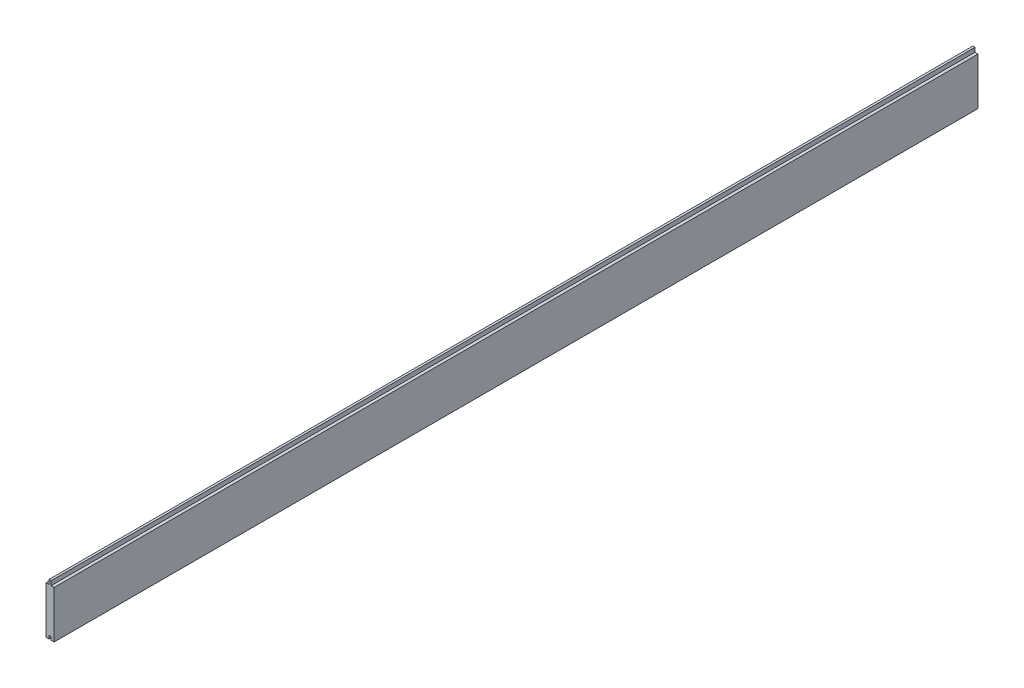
ISO-10303-21;
HEADER;
FILE_DESCRIPTION(('STEP AP214'),'2;1');
FILE_NAME('part.step','',(''),(''),'','','');
FILE_SCHEMA(('AUTOMOTIVE_DESIGN { 1 0 10303 214 1 1 1 1 }'));
ENDSEC;
DATA;
#1=APPLICATION_CONTEXT('core data for automotive mechanical design processes');
#2=APPLICATION_PROTOCOL_DEFINITION('international standard','automotive_design',2000,#1);
#3=PRODUCT_CONTEXT('',#1,'mechanical');
#4=PRODUCT('Part','Part','',(#3));
#5=PRODUCT_RELATED_PRODUCT_CATEGORY('part','',(#4));
#6=PRODUCT_DEFINITION_FORMATION('','',#4);
#7=PRODUCT_DEFINITION_CONTEXT('part definition',#1,'design');
#8=PRODUCT_DEFINITION('design','',#6,#7);
#9=PRODUCT_DEFINITION_SHAPE('','',#8);
#10=(LENGTH_UNIT() NAMED_UNIT(*) SI_UNIT(.MILLI.,.METRE.));
#11=(NAMED_UNIT(*) PLANE_ANGLE_UNIT() SI_UNIT($,.RADIAN.));
#12=(NAMED_UNIT(*) SI_UNIT($,.STERADIAN.) SOLID_ANGLE_UNIT());
#13=UNCERTAINTY_MEASURE_WITH_UNIT(LENGTH_MEASURE(1.E-05),#10,'distance_accuracy_value','');
#14=(GEOMETRIC_REPRESENTATION_CONTEXT(3) GLOBAL_UNCERTAINTY_ASSIGNED_CONTEXT((#13)) GLOBAL_UNIT_ASSIGNED_CONTEXT((#10,
#11,#12)) REPRESENTATION_CONTEXT('',''));
#15=CARTESIAN_POINT('',(0.,0.,0.));
#16=DIRECTION('',(0.,0.,1.));
#17=DIRECTION('',(1.,0.,0.));
#18=AXIS2_PLACEMENT_3D('',#15,#16,#17);
#19=CARTESIAN_POINT('',(0.,43.5,1700.));
#20=DIRECTION('',(0.,1.,0.));
#21=DIRECTION('',(0.,0.,1.));
#22=AXIS2_PLACEMENT_3D('',#19,#20,#21);
#23=PLANE('',#22);
#24=DIRECTION('',(1.,0.,0.));
#25=VECTOR('',#24,1.);
#26=CARTESIAN_POINT('',(0.,43.5,0.));
#27=LINE('',#26,#25);
#28=CARTESIAN_POINT('',(2.,43.5,0.));
#29=VERTEX_POINT('',#28);
#30=CARTESIAN_POINT('',(7.5,43.5,0.));
#31=VERTEX_POINT('',#30);
#32=EDGE_CURVE('E208',#29,#31,#27,.T.);
#33=ORIENTED_EDGE('',*,*,#32,.F.);
#34=DIRECTION('',(0.,0.,-1.));
#35=VECTOR('',#34,1.);
#36=CARTESIAN_POINT('',(2.,43.5,1700.));
#37=LINE('',#36,#35);
#38=CARTESIAN_POINT('',(2.,43.5,1700.));
#39=VERTEX_POINT('',#38);
#40=EDGE_CURVE('E11',#39,#29,#37,.T.);
#41=ORIENTED_EDGE('',*,*,#40,.F.);
#42=DIRECTION('',(1.,0.,0.));
#43=VECTOR('',#42,1.);
#44=CARTESIAN_POINT('',(0.,43.5,1700.));
#45=LINE('',#44,#43);
#46=CARTESIAN_POINT('',(7.5,43.5,1700.));
#47=VERTEX_POINT('',#46);
#48=EDGE_CURVE('E164',#39,#47,#45,.T.);
#49=ORIENTED_EDGE('',*,*,#48,.T.);
#50=DIRECTION('',(0.,0.,-1.));
#51=VECTOR('',#50,1.);
#52=CARTESIAN_POINT('',(7.5,43.5,1700.));
#53=LINE('',#52,#51);
#54=EDGE_CURVE('E49',#47,#31,#53,.T.);
#55=ORIENTED_EDGE('',*,*,#54,.T.);
#56=EDGE_LOOP('',(#33,#41,#49,#55));
#57=FACE_BOUND('',#56,.T.);
#58=ADVANCED_FACE('F32',(#57),#23,.T.);
#59=CARTESIAN_POINT('',(2.00000000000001,0.,1700.));
#60=DIRECTION('',(1.,0.,0.));
#61=DIRECTION('',(0.,1.,0.));
#62=AXIS2_PLACEMENT_3D('',#59,#60,#61);
#63=PLANE('',#62);
#64=DIRECTION('',(0.,-1.,0.));
#65=VECTOR('',#64,1.);
#66=CARTESIAN_POINT('',(2.00000000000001,0.,0.));
#67=LINE('',#66,#65);
#68=CARTESIAN_POINT('',(2.,51.5,0.));
#69=VERTEX_POINT('',#68);
#70=EDGE_CURVE('E207',#69,#29,#67,.T.);
#71=ORIENTED_EDGE('',*,*,#70,.F.);
#72=DIRECTION('',(0.,0.,-1.));
#73=VECTOR('',#72,1.);
#74=CARTESIAN_POINT('',(2.,51.5,1700.));
#75=LINE('',#74,#73);
#76=CARTESIAN_POINT('',(2.,51.5,1700.));
#77=VERTEX_POINT('',#76);
#78=EDGE_CURVE('E41',#77,#69,#75,.T.);
#79=ORIENTED_EDGE('',*,*,#78,.F.);
#80=DIRECTION('',(0.,-1.,0.));
#81=VECTOR('',#80,1.);
#82=CARTESIAN_POINT('',(2.00000000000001,0.,1700.));
#83=LINE('',#82,#81);
#84=EDGE_CURVE('E170',#77,#39,#83,.T.);
#85=ORIENTED_EDGE('',*,*,#84,.T.);
#86=ORIENTED_EDGE('',*,*,#40,.T.);
#87=EDGE_LOOP('',(#71,#79,#85,#86));
#88=FACE_BOUND('',#87,.T.);
#89=ADVANCED_FACE('F34',(#88),#63,.T.);
#90=CARTESIAN_POINT('',(0.,51.5,1700.));
#91=DIRECTION('',(0.,1.,0.));
#92=DIRECTION('',(0.,0.,1.));
#93=AXIS2_PLACEMENT_3D('',#90,#91,#92);
#94=PLANE('',#93);
#95=DIRECTION('',(1.,0.,0.));
#96=VECTOR('',#95,1.);
#97=CARTESIAN_POINT('',(0.,51.5,0.));
#98=LINE('',#97,#96);
#99=CARTESIAN_POINT('',(-2.,51.5,0.));
#100=VERTEX_POINT('',#99);
#101=EDGE_CURVE('E202',#100,#69,#98,.T.);
#102=ORIENTED_EDGE('',*,*,#101,.F.);
#103=DIRECTION('',(0.,0.,-1.));
#104=VECTOR('',#103,1.);
#105=CARTESIAN_POINT('',(-2.,51.5,1700.));
#106=LINE('',#105,#104);
#107=CARTESIAN_POINT('',(-2.,51.5,1700.));
#108=VERTEX_POINT('',#107);
#109=EDGE_CURVE('E196',#108,#100,#106,.T.);
#110=ORIENTED_EDGE('',*,*,#109,.F.);
#111=DIRECTION('',(1.,0.,0.));
#112=VECTOR('',#111,1.);
#113=CARTESIAN_POINT('',(0.,51.5,1700.));
#114=LINE('',#113,#112);
#115=EDGE_CURVE('E167',#108,#77,#114,.T.);
#116=ORIENTED_EDGE('',*,*,#115,.T.);
#117=ORIENTED_EDGE('',*,*,#78,.T.);
#118=EDGE_LOOP('',(#102,#110,#116,#117));
#119=FACE_BOUND('',#118,.T.);
#120=ADVANCED_FACE('F200',(#119),#94,.T.);
#121=CARTESIAN_POINT('',(-1.99999999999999,0.,1700.));
#122=DIRECTION('',(1.,0.,0.));
#123=DIRECTION('',(0.,1.,0.));
#124=AXIS2_PLACEMENT_3D('',#121,#122,#123);
#125=PLANE('',#124);
#126=DIRECTION('',(0.,-1.,0.));
#127=VECTOR('',#126,1.);
#128=CARTESIAN_POINT('',(-1.99999999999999,0.,0.));
#129=LINE('',#128,#127);
#130=CARTESIAN_POINT('',(-2.,43.5,0.));
#131=VERTEX_POINT('',#130);
#132=EDGE_CURVE('E214',#100,#131,#129,.T.);
#133=ORIENTED_EDGE('',*,*,#132,.T.);
#134=DIRECTION('',(0.,0.,-1.));
#135=VECTOR('',#134,1.);
#136=CARTESIAN_POINT('',(-2.,43.5,1700.));
#137=LINE('',#136,#135);
#138=CARTESIAN_POINT('',(-2.,43.5,1700.));
#139=VERTEX_POINT('',#138);
#140=EDGE_CURVE('E194',#139,#131,#137,.T.);
#141=ORIENTED_EDGE('',*,*,#140,.F.);
#142=DIRECTION('',(0.,-1.,0.));
#143=VECTOR('',#142,1.);
#144=CARTESIAN_POINT('',(-1.99999999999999,0.,1700.));
#145=LINE('',#144,#143);
#146=EDGE_CURVE('E162',#108,#139,#145,.T.);
#147=ORIENTED_EDGE('',*,*,#146,.F.);
#148=ORIENTED_EDGE('',*,*,#109,.T.);
#149=EDGE_LOOP('',(#133,#141,#147,#148));
#150=FACE_BOUND('',#149,.T.);
#151=ADVANCED_FACE('F260',(#150),#125,.F.);
#152=CARTESIAN_POINT('',(-7.5,43.5,0.));
#153=VERTEX_POINT('',#152);
#154=EDGE_CURVE('E216',#153,#131,#27,.T.);
#155=ORIENTED_EDGE('',*,*,#154,.F.);
#156=DIRECTION('',(0.,0.,-1.));
#157=VECTOR('',#156,1.);
#158=CARTESIAN_POINT('',(-7.5,43.5,1700.));
#159=LINE('',#158,#157);
#160=CARTESIAN_POINT('',(-7.5,43.5,1700.));
#161=VERTEX_POINT('',#160);
#162=EDGE_CURVE('E192',#161,#153,#159,.T.);
#163=ORIENTED_EDGE('',*,*,#162,.F.);
#164=EDGE_CURVE('E157',#161,#139,#45,.T.);
#165=ORIENTED_EDGE('',*,*,#164,.T.);
#166=ORIENTED_EDGE('',*,*,#140,.T.);
#167=EDGE_LOOP('',(#155,#163,#165,#166));
#168=FACE_BOUND('',#167,.T.);
#169=ADVANCED_FACE('F239',(#168),#23,.T.);
#170=CARTESIAN_POINT('',(-7.5,0.,1700.));
#171=DIRECTION('',(1.,0.,0.));
#172=DIRECTION('',(0.,1.,0.));
#173=AXIS2_PLACEMENT_3D('',#170,#171,#172);
#174=PLANE('',#173);
#175=DIRECTION('',(0.,-1.,0.));
#176=VECTOR('',#175,1.);
#177=CARTESIAN_POINT('',(-7.5,0.,0.));
#178=LINE('',#177,#176);
#179=CARTESIAN_POINT('',(-7.49999999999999,-43.5,0.));
#180=VERTEX_POINT('',#179);
#181=EDGE_CURVE('E220',#153,#180,#178,.T.);
#182=ORIENTED_EDGE('',*,*,#181,.T.);
#183=DIRECTION('',(0.,0.,-1.));
#184=VECTOR('',#183,1.);
#185=CARTESIAN_POINT('',(-7.49999999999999,-43.5,1700.));
#186=LINE('',#185,#184);
#187=CARTESIAN_POINT('',(-7.49999999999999,-43.5,1700.));
#188=VERTEX_POINT('',#187);
#189=EDGE_CURVE('E189',#188,#180,#186,.T.);
#190=ORIENTED_EDGE('',*,*,#189,.F.);
#191=DIRECTION('',(0.,-1.,0.));
#192=VECTOR('',#191,1.);
#193=CARTESIAN_POINT('',(-7.5,0.,1700.));
#194=LINE('',#193,#192);
#195=EDGE_CURVE('E153',#161,#188,#194,.T.);
#196=ORIENTED_EDGE('',*,*,#195,.F.);
#197=ORIENTED_EDGE('',*,*,#162,.T.);
#198=EDGE_LOOP('',(#182,#190,#196,#197));
#199=FACE_BOUND('',#198,.T.);
#200=ADVANCED_FACE('F259',(#199),#174,.F.);
#201=CARTESIAN_POINT('',(0.,-43.5,1700.));
#202=DIRECTION('',(0.,1.,0.));
#203=DIRECTION('',(0.,0.,1.));
#204=AXIS2_PLACEMENT_3D('',#201,#202,#203);
#205=PLANE('',#204);
#206=DIRECTION('',(1.,0.,0.));
#207=VECTOR('',#206,1.);
#208=CARTESIAN_POINT('',(0.,-43.5,0.));
#209=LINE('',#208,#207);
#210=CARTESIAN_POINT('',(-2.,-43.5,0.));
#211=VERTEX_POINT('',#210);
#212=EDGE_CURVE('E178',#180,#211,#209,.T.);
#213=ORIENTED_EDGE('',*,*,#212,.T.);
#214=DIRECTION('',(0.,0.,-1.));
#215=VECTOR('',#214,1.);
#216=CARTESIAN_POINT('',(-2.,-43.5,1700.));
#217=LINE('',#216,#215);
#218=CARTESIAN_POINT('',(-2.,-43.5,1700.));
#219=VERTEX_POINT('',#218);
#220=EDGE_CURVE('E187',#219,#211,#217,.T.);
#221=ORIENTED_EDGE('',*,*,#220,.F.);
#222=DIRECTION('',(1.,0.,0.));
#223=VECTOR('',#222,1.);
#224=CARTESIAN_POINT('',(0.,-43.5,1700.));
#225=LINE('',#224,#223);
#226=EDGE_CURVE('E148',#188,#219,#225,.T.);
#227=ORIENTED_EDGE('',*,*,#226,.F.);
#228=ORIENTED_EDGE('',*,*,#189,.T.);
#229=EDGE_LOOP('',(#213,#221,#227,#228));
#230=FACE_BOUND('',#229,.T.);
#231=ADVANCED_FACE('F234',(#230),#205,.F.);
#232=CARTESIAN_POINT('',(-2.,0.,1700.));
#233=DIRECTION('',(1.,0.,0.));
#234=DIRECTION('',(0.,1.,0.));
#235=AXIS2_PLACEMENT_3D('',#232,#233,#234);
#236=PLANE('',#235);
#237=DIRECTION('',(0.,-1.,0.));
#238=VECTOR('',#237,1.);
#239=CARTESIAN_POINT('',(-2.,0.,0.));
#240=LINE('',#239,#238);
#241=CARTESIAN_POINT('',(-2.,-37.5,0.));
#242=VERTEX_POINT('',#241);
#243=EDGE_CURVE('E223',#242,#211,#240,.T.);
#244=ORIENTED_EDGE('',*,*,#243,.F.);
#245=DIRECTION('',(0.,0.,-1.));
#246=VECTOR('',#245,1.);
#247=CARTESIAN_POINT('',(-2.,-37.5,1700.));
#248=LINE('',#247,#246);
#249=CARTESIAN_POINT('',(-2.,-37.5,1700.));
#250=VERTEX_POINT('',#249);
#251=EDGE_CURVE('E185',#250,#242,#248,.T.);
#252=ORIENTED_EDGE('',*,*,#251,.F.);
#253=DIRECTION('',(0.,-1.,0.));
#254=VECTOR('',#253,1.);
#255=CARTESIAN_POINT('',(-2.,0.,1700.));
#256=LINE('',#255,#254);
#257=EDGE_CURVE('E152',#250,#219,#256,.T.);
#258=ORIENTED_EDGE('',*,*,#257,.T.);
#259=ORIENTED_EDGE('',*,*,#220,.T.);
#260=EDGE_LOOP('',(#244,#252,#258,#259));
#261=FACE_BOUND('',#260,.T.);
#262=ADVANCED_FACE('F232',(#261),#236,.T.);
#263=CARTESIAN_POINT('',(0.,-37.5,1700.));
#264=DIRECTION('',(0.,1.,0.));
#265=DIRECTION('',(0.,0.,1.));
#266=AXIS2_PLACEMENT_3D('',#263,#264,#265);
#267=PLANE('',#266);
#268=DIRECTION('',(1.,0.,0.));
#269=VECTOR('',#268,1.);
#270=CARTESIAN_POINT('',(0.,-37.5,0.));
#271=LINE('',#270,#269);
#272=CARTESIAN_POINT('',(2.,-37.5,0.));
#273=VERTEX_POINT('',#272);
#274=EDGE_CURVE('E225',#242,#273,#271,.T.);
#275=ORIENTED_EDGE('',*,*,#274,.T.);
#276=DIRECTION('',(0.,0.,-1.));
#277=VECTOR('',#276,1.);
#278=CARTESIAN_POINT('',(2.,-37.5,1700.));
#279=LINE('',#278,#277);
#280=CARTESIAN_POINT('',(2.,-37.5,1700.));
#281=VERTEX_POINT('',#280);
#282=EDGE_CURVE('E143',#281,#273,#279,.T.);
#283=ORIENTED_EDGE('',*,*,#282,.F.);
#284=DIRECTION('',(1.,0.,0.));
#285=VECTOR('',#284,1.);
#286=CARTESIAN_POINT('',(0.,-37.5,1700.));
#287=LINE('',#286,#285);
#288=EDGE_CURVE('E131',#250,#281,#287,.T.);
#289=ORIENTED_EDGE('',*,*,#288,.F.);
#290=ORIENTED_EDGE('',*,*,#251,.T.);
#291=EDGE_LOOP('',(#275,#283,#289,#290));
#292=FACE_BOUND('',#291,.T.);
#293=ADVANCED_FACE('F228',(#292),#267,.F.);
#294=CARTESIAN_POINT('',(1.99999999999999,0.,1700.));
#295=DIRECTION('',(1.,0.,0.));
#296=DIRECTION('',(0.,1.,0.));
#297=AXIS2_PLACEMENT_3D('',#294,#295,#296);
#298=PLANE('',#297);
#299=DIRECTION('',(0.,-1.,0.));
#300=VECTOR('',#299,1.);
#301=CARTESIAN_POINT('',(1.99999999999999,0.,0.));
#302=LINE('',#301,#300);
#303=CARTESIAN_POINT('',(2.,-43.5,0.));
#304=VERTEX_POINT('',#303);
#305=EDGE_CURVE('E140',#273,#304,#302,.T.);
#306=ORIENTED_EDGE('',*,*,#305,.T.);
#307=DIRECTION('',(0.,0.,-1.));
#308=VECTOR('',#307,1.);
#309=CARTESIAN_POINT('',(2.,-43.5,1700.));
#310=LINE('',#309,#308);
#311=CARTESIAN_POINT('',(2.,-43.5,1700.));
#312=VERTEX_POINT('',#311);
#313=EDGE_CURVE('E137',#312,#304,#310,.T.);
#314=ORIENTED_EDGE('',*,*,#313,.F.);
#315=DIRECTION('',(0.,-1.,0.));
#316=VECTOR('',#315,1.);
#317=CARTESIAN_POINT('',(1.99999999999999,0.,1700.));
#318=LINE('',#317,#316);
#319=EDGE_CURVE('E123',#281,#312,#318,.T.);
#320=ORIENTED_EDGE('',*,*,#319,.F.);
#321=ORIENTED_EDGE('',*,*,#282,.T.);
#322=EDGE_LOOP('',(#306,#314,#320,#321));
#323=FACE_BOUND('',#322,.T.);
#324=ADVANCED_FACE('F138',(#323),#298,.F.);
#325=CARTESIAN_POINT('',(7.50000000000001,-43.5,0.));
#326=VERTEX_POINT('',#325);
#327=EDGE_CURVE('E174',#304,#326,#209,.T.);
#328=ORIENTED_EDGE('',*,*,#327,.T.);
#329=DIRECTION('',(0.,0.,-1.));
#330=VECTOR('',#329,1.);
#331=CARTESIAN_POINT('',(7.50000000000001,-43.5,1700.));
#332=LINE('',#331,#330);
#333=CARTESIAN_POINT('',(7.50000000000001,-43.5,1700.));
#334=VERTEX_POINT('',#333);
#335=EDGE_CURVE('E87',#334,#326,#332,.T.);
#336=ORIENTED_EDGE('',*,*,#335,.F.);
#337=EDGE_CURVE('E128',#312,#334,#225,.T.);
#338=ORIENTED_EDGE('',*,*,#337,.F.);
#339=ORIENTED_EDGE('',*,*,#313,.T.);
#340=EDGE_LOOP('',(#328,#336,#338,#339));
#341=FACE_BOUND('',#340,.T.);
#342=ADVANCED_FACE('F145',(#341),#205,.F.);
#343=CARTESIAN_POINT('',(7.5,0.,1700.));
#344=DIRECTION('',(1.,0.,0.));
#345=DIRECTION('',(0.,1.,0.));
#346=AXIS2_PLACEMENT_3D('',#343,#344,#345);
#347=PLANE('',#346);
#348=DIRECTION('',(0.,-1.,0.));
#349=VECTOR('',#348,1.);
#350=CARTESIAN_POINT('',(7.5,0.,0.));
#351=LINE('',#350,#349);
#352=EDGE_CURVE('E172',#31,#326,#351,.T.);
#353=ORIENTED_EDGE('',*,*,#352,.F.);
#354=ORIENTED_EDGE('',*,*,#54,.F.);
#355=DIRECTION('',(0.,-1.,0.));
#356=VECTOR('',#355,1.);
#357=CARTESIAN_POINT('',(7.5,0.,1700.));
#358=LINE('',#357,#356);
#359=EDGE_CURVE('E146',#47,#334,#358,.T.);
#360=ORIENTED_EDGE('',*,*,#359,.T.);
#361=ORIENTED_EDGE('',*,*,#335,.T.);
#362=EDGE_LOOP('',(#353,#354,#360,#361));
#363=FACE_BOUND('',#362,.T.);
#364=ADVANCED_FACE('F241',(#363),#347,.T.);
#365=CARTESIAN_POINT('',(0.,0.,1700.));
#366=DIRECTION('',(0.,0.,1.));
#367=DIRECTION('',(1.,0.,0.));
#368=AXIS2_PLACEMENT_3D('',#365,#366,#367);
#369=PLANE('',#368);
#370=ORIENTED_EDGE('',*,*,#48,.F.);
#371=ORIENTED_EDGE('',*,*,#84,.F.);
#372=ORIENTED_EDGE('',*,*,#115,.F.);
#373=ORIENTED_EDGE('',*,*,#146,.T.);
#374=ORIENTED_EDGE('',*,*,#164,.F.);
#375=ORIENTED_EDGE('',*,*,#195,.T.);
#376=ORIENTED_EDGE('',*,*,#226,.T.);
#377=ORIENTED_EDGE('',*,*,#257,.F.);
#378=ORIENTED_EDGE('',*,*,#288,.T.);
#379=ORIENTED_EDGE('',*,*,#319,.T.);
#380=ORIENTED_EDGE('',*,*,#337,.T.);
#381=ORIENTED_EDGE('',*,*,#359,.F.);
#382=EDGE_LOOP('',(#370,#371,#372,#373,#374,#375,#376,#377,#378,#379,#380,#381));
#383=FACE_BOUND('',#382,.T.);
#384=ADVANCED_FACE('F125',(#383),#369,.T.);
#385=CARTESIAN_POINT('',(0.,0.,0.));
#386=DIRECTION('',(0.,0.,1.));
#387=DIRECTION('',(1.,0.,0.));
#388=AXIS2_PLACEMENT_3D('',#385,#386,#387);
#389=PLANE('',#388);
#390=ORIENTED_EDGE('',*,*,#32,.T.);
#391=ORIENTED_EDGE('',*,*,#352,.T.);
#392=ORIENTED_EDGE('',*,*,#327,.F.);
#393=ORIENTED_EDGE('',*,*,#305,.F.);
#394=ORIENTED_EDGE('',*,*,#274,.F.);
#395=ORIENTED_EDGE('',*,*,#243,.T.);
#396=ORIENTED_EDGE('',*,*,#212,.F.);
#397=ORIENTED_EDGE('',*,*,#181,.F.);
#398=ORIENTED_EDGE('',*,*,#154,.T.);
#399=ORIENTED_EDGE('',*,*,#132,.F.);
#400=ORIENTED_EDGE('',*,*,#101,.T.);
#401=ORIENTED_EDGE('',*,*,#70,.T.);
#402=EDGE_LOOP('',(#390,#391,#392,#393,#394,#395,#396,#397,#398,#399,#400,#401));
#403=FACE_BOUND('',#402,.T.);
#404=ADVANCED_FACE('F211',(#403),#389,.F.);
#405=CLOSED_SHELL('',(#58,#89,#120,#151,#169,#200,#231,#262,#293,#324,#342,#364,#384,#404));
#406=MANIFOLD_SOLID_BREP('B2',#405);
#407=ADVANCED_BREP_SHAPE_REPRESENTATION('',(#18,#406),#14);
#408=SHAPE_DEFINITION_REPRESENTATION(#9,#407);
ENDSEC;
END-ISO-10303-21;
